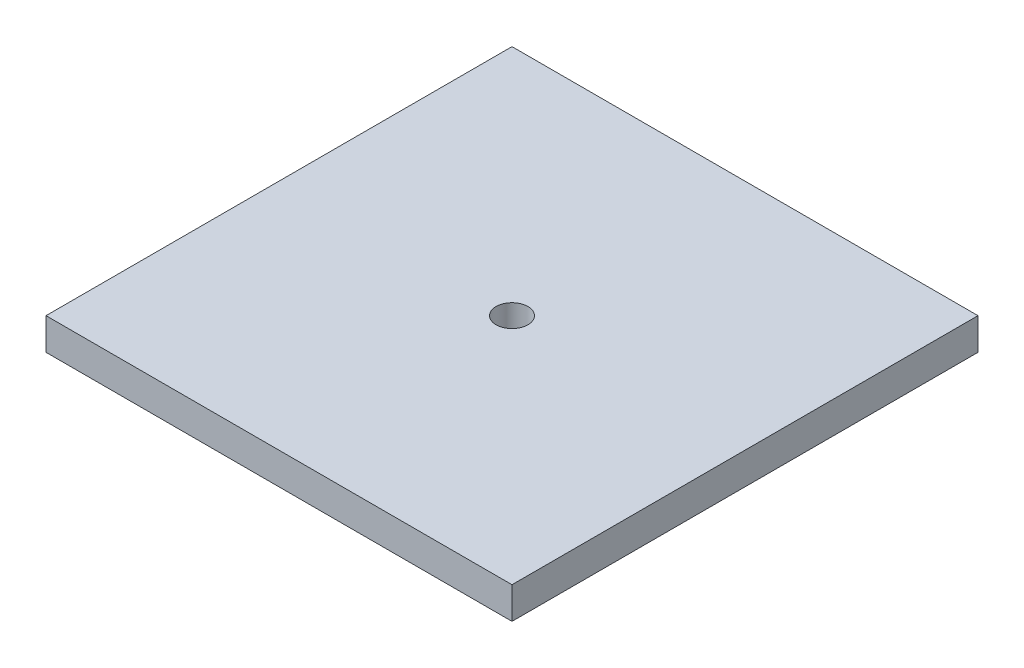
ISO-10303-21;
HEADER;
FILE_DESCRIPTION(('STEP AP214'),'2;1');
FILE_NAME('part.step','',(''),(''),'','','');
FILE_SCHEMA(('AUTOMOTIVE_DESIGN { 1 0 10303 214 1 1 1 1 }'));
ENDSEC;
DATA;
#1=APPLICATION_CONTEXT('core data for automotive mechanical design processes');
#2=APPLICATION_PROTOCOL_DEFINITION('international standard','automotive_design',2000,#1);
#3=PRODUCT_CONTEXT('',#1,'mechanical');
#4=PRODUCT('Part','Part','',(#3));
#5=PRODUCT_RELATED_PRODUCT_CATEGORY('part','',(#4));
#6=PRODUCT_DEFINITION_FORMATION('','',#4);
#7=PRODUCT_DEFINITION_CONTEXT('part definition',#1,'design');
#8=PRODUCT_DEFINITION('design','',#6,#7);
#9=PRODUCT_DEFINITION_SHAPE('','',#8);
#10=(LENGTH_UNIT() NAMED_UNIT(*) SI_UNIT(.MILLI.,.METRE.));
#11=(NAMED_UNIT(*) PLANE_ANGLE_UNIT() SI_UNIT($,.RADIAN.));
#12=(NAMED_UNIT(*) SI_UNIT($,.STERADIAN.) SOLID_ANGLE_UNIT());
#13=UNCERTAINTY_MEASURE_WITH_UNIT(LENGTH_MEASURE(1.E-05),#10,'distance_accuracy_value','');
#14=(GEOMETRIC_REPRESENTATION_CONTEXT(3) GLOBAL_UNCERTAINTY_ASSIGNED_CONTEXT((#13)) GLOBAL_UNIT_ASSIGNED_CONTEXT((#10,
#11,#12)) REPRESENTATION_CONTEXT('',''));
#15=CARTESIAN_POINT('',(0.,0.,0.));
#16=DIRECTION('',(0.,0.,1.));
#17=DIRECTION('',(1.,0.,0.));
#18=AXIS2_PLACEMENT_3D('',#15,#16,#17);
#19=CARTESIAN_POINT('',(0.,6.,-88.));
#20=DIRECTION('',(0.,-1.,0.));
#21=DIRECTION('',(0.,0.,-1.));
#22=AXIS2_PLACEMENT_3D('',#19,#20,#21);
#23=PLANE('',#22);
#24=DIRECTION('',(0.,0.,1.));
#25=VECTOR('',#24,1.);
#26=CARTESIAN_POINT('',(0.,6.,0.));
#27=LINE('',#26,#25);
#28=CARTESIAN_POINT('',(0.,6.,-88.));
#29=VERTEX_POINT('',#28);
#30=CARTESIAN_POINT('',(0.,6.,0.));
#31=VERTEX_POINT('',#30);
#32=EDGE_CURVE('E95',#29,#31,#27,.T.);
#33=ORIENTED_EDGE('',*,*,#32,.T.);
#34=DIRECTION('',(1.,0.,0.));
#35=VECTOR('',#34,1.);
#36=CARTESIAN_POINT('',(0.,6.,0.));
#37=LINE('',#36,#35);
#38=CARTESIAN_POINT('',(88.,6.,0.));
#39=VERTEX_POINT('',#38);
#40=EDGE_CURVE('E80',#31,#39,#37,.T.);
#41=ORIENTED_EDGE('',*,*,#40,.T.);
#42=DIRECTION('',(0.,0.,-1.));
#43=VECTOR('',#42,1.);
#44=CARTESIAN_POINT('',(88.,6.,0.));
#45=LINE('',#44,#43);
#46=CARTESIAN_POINT('',(88.,6.,-88.));
#47=VERTEX_POINT('',#46);
#48=EDGE_CURVE('E46',#39,#47,#45,.T.);
#49=ORIENTED_EDGE('',*,*,#48,.T.);
#50=DIRECTION('',(-1.,0.,0.));
#51=VECTOR('',#50,1.);
#52=CARTESIAN_POINT('',(0.,6.,-88.));
#53=LINE('',#52,#51);
#54=EDGE_CURVE('E41',#47,#29,#53,.T.);
#55=ORIENTED_EDGE('',*,*,#54,.T.);
#56=EDGE_LOOP('',(#33,#41,#49,#55));
#57=FACE_BOUND('',#56,.T.);
#58=CARTESIAN_POINT('',(44.,6.,-44.));
#59=DIRECTION('',(0.,1.,0.));
#60=DIRECTION('',(0.,0.,1.));
#61=AXIS2_PLACEMENT_3D('',#58,#59,#60);
#62=CIRCLE('',#61,3.);
#63=CARTESIAN_POINT('',(44.,6.,-41.));
#64=VERTEX_POINT('',#63);
#65=EDGE_CURVE('E85',#64,#64,#62,.T.);
#66=ORIENTED_EDGE('',*,*,#65,.F.);
#67=EDGE_LOOP('',(#66));
#68=FACE_BOUND('',#67,.T.);
#69=ADVANCED_FACE('F26',(#57,#68),#23,.F.);
#70=CARTESIAN_POINT('',(0.,0.,-88.));
#71=DIRECTION('',(0.,-1.,0.));
#72=DIRECTION('',(0.,0.,-1.));
#73=AXIS2_PLACEMENT_3D('',#70,#71,#72);
#74=PLANE('',#73);
#75=DIRECTION('',(0.,0.,1.));
#76=VECTOR('',#75,1.);
#77=CARTESIAN_POINT('',(0.,0.,0.));
#78=LINE('',#77,#76);
#79=CARTESIAN_POINT('',(0.,0.,-88.));
#80=VERTEX_POINT('',#79);
#81=CARTESIAN_POINT('',(0.,0.,0.));
#82=VERTEX_POINT('',#81);
#83=EDGE_CURVE('E72',#80,#82,#78,.T.);
#84=ORIENTED_EDGE('',*,*,#83,.F.);
#85=DIRECTION('',(-1.,0.,0.));
#86=VECTOR('',#85,1.);
#87=CARTESIAN_POINT('',(0.,0.,-88.));
#88=LINE('',#87,#86);
#89=CARTESIAN_POINT('',(88.,0.,-88.));
#90=VERTEX_POINT('',#89);
#91=EDGE_CURVE('E93',#90,#80,#88,.T.);
#92=ORIENTED_EDGE('',*,*,#91,.F.);
#93=DIRECTION('',(0.,0.,-1.));
#94=VECTOR('',#93,1.);
#95=CARTESIAN_POINT('',(88.,0.,0.));
#96=LINE('',#95,#94);
#97=CARTESIAN_POINT('',(88.,0.,0.));
#98=VERTEX_POINT('',#97);
#99=EDGE_CURVE('E73',#98,#90,#96,.T.);
#100=ORIENTED_EDGE('',*,*,#99,.F.);
#101=DIRECTION('',(1.,0.,0.));
#102=VECTOR('',#101,1.);
#103=CARTESIAN_POINT('',(0.,0.,0.));
#104=LINE('',#103,#102);
#105=EDGE_CURVE('E67',#82,#98,#104,.T.);
#106=ORIENTED_EDGE('',*,*,#105,.F.);
#107=EDGE_LOOP('',(#84,#92,#100,#106));
#108=FACE_BOUND('',#107,.T.);
#109=CARTESIAN_POINT('',(44.,0.,-44.));
#110=DIRECTION('',(0.,1.,0.));
#111=DIRECTION('',(0.,0.,1.));
#112=AXIS2_PLACEMENT_3D('',#109,#110,#111);
#113=CIRCLE('',#112,3.);
#114=CARTESIAN_POINT('',(44.,0.,-41.));
#115=VERTEX_POINT('',#114);
#116=EDGE_CURVE('E88',#115,#115,#113,.T.);
#117=ORIENTED_EDGE('',*,*,#116,.T.);
#118=EDGE_LOOP('',(#117));
#119=FACE_BOUND('',#118,.T.);
#120=ADVANCED_FACE('F68',(#108,#119),#74,.T.);
#121=CARTESIAN_POINT('',(0.,6.,0.));
#122=DIRECTION('',(1.,0.,0.));
#123=DIRECTION('',(0.,0.,-1.));
#124=AXIS2_PLACEMENT_3D('',#121,#122,#123);
#125=PLANE('',#124);
#126=ORIENTED_EDGE('',*,*,#83,.T.);
#127=DIRECTION('',(0.,-1.,0.));
#128=VECTOR('',#127,1.);
#129=CARTESIAN_POINT('',(0.,6.,0.));
#130=LINE('',#129,#128);
#131=EDGE_CURVE('E11',#31,#82,#130,.T.);
#132=ORIENTED_EDGE('',*,*,#131,.F.);
#133=ORIENTED_EDGE('',*,*,#32,.F.);
#134=DIRECTION('',(0.,-1.,0.));
#135=VECTOR('',#134,1.);
#136=CARTESIAN_POINT('',(0.,6.,-88.));
#137=LINE('',#136,#135);
#138=EDGE_CURVE('E84',#29,#80,#137,.T.);
#139=ORIENTED_EDGE('',*,*,#138,.T.);
#140=EDGE_LOOP('',(#126,#132,#133,#139));
#141=FACE_BOUND('',#140,.T.);
#142=ADVANCED_FACE('F28',(#141),#125,.F.);
#143=CARTESIAN_POINT('',(0.,6.,0.));
#144=DIRECTION('',(0.,0.,-1.));
#145=DIRECTION('',(-1.,0.,0.));
#146=AXIS2_PLACEMENT_3D('',#143,#144,#145);
#147=PLANE('',#146);
#148=ORIENTED_EDGE('',*,*,#105,.T.);
#149=DIRECTION('',(0.,-1.,0.));
#150=VECTOR('',#149,1.);
#151=CARTESIAN_POINT('',(88.,6.,0.));
#152=LINE('',#151,#150);
#153=EDGE_CURVE('E34',#39,#98,#152,.T.);
#154=ORIENTED_EDGE('',*,*,#153,.F.);
#155=ORIENTED_EDGE('',*,*,#40,.F.);
#156=ORIENTED_EDGE('',*,*,#131,.T.);
#157=EDGE_LOOP('',(#148,#154,#155,#156));
#158=FACE_BOUND('',#157,.T.);
#159=ADVANCED_FACE('F79',(#158),#147,.F.);
#160=CARTESIAN_POINT('',(88.,6.,0.));
#161=DIRECTION('',(-1.,0.,0.));
#162=DIRECTION('',(0.,0.,1.));
#163=AXIS2_PLACEMENT_3D('',#160,#161,#162);
#164=PLANE('',#163);
#165=ORIENTED_EDGE('',*,*,#99,.T.);
#166=DIRECTION('',(0.,-1.,0.));
#167=VECTOR('',#166,1.);
#168=CARTESIAN_POINT('',(88.,6.,-88.));
#169=LINE('',#168,#167);
#170=EDGE_CURVE('E101',#47,#90,#169,.T.);
#171=ORIENTED_EDGE('',*,*,#170,.F.);
#172=ORIENTED_EDGE('',*,*,#48,.F.);
#173=ORIENTED_EDGE('',*,*,#153,.T.);
#174=EDGE_LOOP('',(#165,#171,#172,#173));
#175=FACE_BOUND('',#174,.T.);
#176=ADVANCED_FACE('F104',(#175),#164,.F.);
#177=CARTESIAN_POINT('',(0.,6.,-88.));
#178=DIRECTION('',(0.,0.,1.));
#179=DIRECTION('',(1.,0.,0.));
#180=AXIS2_PLACEMENT_3D('',#177,#178,#179);
#181=PLANE('',#180);
#182=ORIENTED_EDGE('',*,*,#91,.T.);
#183=ORIENTED_EDGE('',*,*,#138,.F.);
#184=ORIENTED_EDGE('',*,*,#54,.F.);
#185=ORIENTED_EDGE('',*,*,#170,.T.);
#186=EDGE_LOOP('',(#182,#183,#184,#185));
#187=FACE_BOUND('',#186,.T.);
#188=ADVANCED_FACE('F106',(#187),#181,.F.);
#189=CARTESIAN_POINT('',(44.,6.,-44.));
#190=DIRECTION('',(0.,-1.,0.));
#191=DIRECTION('',(0.,0.,-1.));
#192=AXIS2_PLACEMENT_3D('',#189,#190,#191);
#193=CYLINDRICAL_SURFACE('',#192,3.);
#194=ORIENTED_EDGE('',*,*,#65,.T.);
#195=EDGE_LOOP('',(#194));
#196=FACE_BOUND('',#195,.T.);
#197=ORIENTED_EDGE('',*,*,#116,.F.);
#198=EDGE_LOOP('',(#197));
#199=FACE_BOUND('',#198,.T.);
#200=ADVANCED_FACE('F112',(#196,#199),#193,.F.);
#201=CLOSED_SHELL('',(#69,#120,#142,#159,#176,#188,#200));
#202=MANIFOLD_SOLID_BREP('B2',#201);
#203=ADVANCED_BREP_SHAPE_REPRESENTATION('',(#18,#202),#14);
#204=SHAPE_DEFINITION_REPRESENTATION(#9,#203);
ENDSEC;
END-ISO-10303-21;
